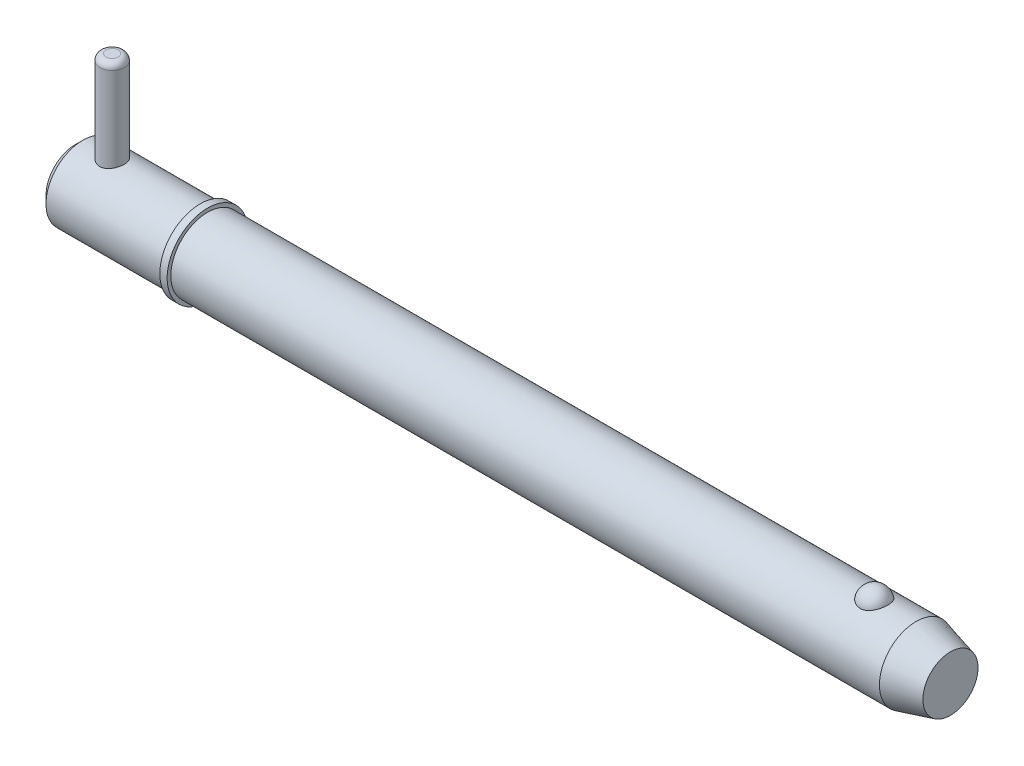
ISO-10303-21;
HEADER;
FILE_DESCRIPTION(('STEP AP214'),'2;1');
FILE_NAME('part.step','',(''),(''),'','','');
FILE_SCHEMA(('AUTOMOTIVE_DESIGN { 1 0 10303 214 1 1 1 1 }'));
ENDSEC;
DATA;
#1=APPLICATION_CONTEXT('core data for automotive mechanical design processes');
#2=APPLICATION_PROTOCOL_DEFINITION('international standard','automotive_design',2000,#1);
#3=PRODUCT_CONTEXT('',#1,'mechanical');
#4=PRODUCT('Part','Part','',(#3));
#5=PRODUCT_RELATED_PRODUCT_CATEGORY('part','',(#4));
#6=PRODUCT_DEFINITION_FORMATION('','',#4);
#7=PRODUCT_DEFINITION_CONTEXT('part definition',#1,'design');
#8=PRODUCT_DEFINITION('design','',#6,#7);
#9=PRODUCT_DEFINITION_SHAPE('','',#8);
#10=(LENGTH_UNIT() NAMED_UNIT(*) SI_UNIT(.MILLI.,.METRE.));
#11=(NAMED_UNIT(*) PLANE_ANGLE_UNIT() SI_UNIT($,.RADIAN.));
#12=(NAMED_UNIT(*) SI_UNIT($,.STERADIAN.) SOLID_ANGLE_UNIT());
#13=UNCERTAINTY_MEASURE_WITH_UNIT(LENGTH_MEASURE(1.E-05),#10,'distance_accuracy_value','');
#14=(GEOMETRIC_REPRESENTATION_CONTEXT(3) GLOBAL_UNCERTAINTY_ASSIGNED_CONTEXT((#13)) GLOBAL_UNIT_ASSIGNED_CONTEXT((#10,
#11,#12)) REPRESENTATION_CONTEXT('',''));
#15=CARTESIAN_POINT('',(0.,0.,0.));
#16=DIRECTION('',(0.,0.,1.));
#17=DIRECTION('',(1.,0.,0.));
#18=AXIS2_PLACEMENT_3D('',#15,#16,#17);
#19=CARTESIAN_POINT('',(7.14,24.605,0.));
#20=DIRECTION('',(0.,-1.,0.));
#21=DIRECTION('',(0.,0.,-1.));
#22=AXIS2_PLACEMENT_3D('',#19,#20,#21);
#23=CYLINDRICAL_SURFACE('',#22,2.38);
#24=CARTESIAN_POINT('',(7.14,-5.955,0.));
#25=DIRECTION('',(0.,1.,0.));
#26=DIRECTION('',(0.,0.,1.));
#27=AXIS2_PLACEMENT_3D('',#24,#25,#26);
#28=CIRCLE('',#27,2.38);
#29=CARTESIAN_POINT('',(7.14,-5.955,2.38));
#30=VERTEX_POINT('',#29);
#31=EDGE_CURVE('P0_E25',#30,#30,#28,.T.);
#32=ORIENTED_EDGE('',*,*,#31,.T.);
#33=EDGE_LOOP('',(#32));
#34=FACE_BOUND('',#33,.T.);
#35=CARTESIAN_POINT('',(7.14,23.415,0.));
#36=DIRECTION('',(0.,1.,0.));
#37=DIRECTION('',(0.,0.,1.));
#38=AXIS2_PLACEMENT_3D('',#35,#36,#37);
#39=CIRCLE('',#38,2.38);
#40=CARTESIAN_POINT('',(7.14,23.415,2.38));
#41=VERTEX_POINT('',#40);
#42=EDGE_CURVE('P0_E29',#41,#41,#39,.F.);
#43=ORIENTED_EDGE('',*,*,#42,.T.);
#44=EDGE_LOOP('',(#43));
#45=FACE_BOUND('',#44,.T.);
#46=ADVANCED_FACE('P0_F14',(#34,#45),#23,.T.);
#47=CARTESIAN_POINT('',(7.14,24.605,0.));
#48=DIRECTION('',(0.,1.,0.));
#49=DIRECTION('',(0.,0.,1.));
#50=AXIS2_PLACEMENT_3D('',#47,#48,#49);
#51=PLANE('',#50);
#52=CARTESIAN_POINT('',(7.14,24.605,0.));
#53=DIRECTION('',(0.,1.,0.));
#54=DIRECTION('',(0.,0.,1.));
#55=AXIS2_PLACEMENT_3D('',#52,#53,#54);
#56=CIRCLE('',#55,1.19);
#57=CARTESIAN_POINT('',(7.14,24.605,1.19));
#58=VERTEX_POINT('',#57);
#59=EDGE_CURVE('P0_E10',#58,#58,#56,.T.);
#60=ORIENTED_EDGE('',*,*,#59,.T.);
#61=EDGE_LOOP('',(#60));
#62=FACE_BOUND('',#61,.T.);
#63=ADVANCED_FACE('P0_F46',(#62),#51,.T.);
#64=CARTESIAN_POINT('',(7.14,-7.145,0.));
#65=DIRECTION('',(0.,1.,0.));
#66=DIRECTION('',(0.,0.,1.));
#67=AXIS2_PLACEMENT_3D('',#64,#65,#66);
#68=PLANE('',#67);
#69=CARTESIAN_POINT('',(7.14,-7.145,0.));
#70=DIRECTION('',(0.,1.,0.));
#71=DIRECTION('',(0.,0.,1.));
#72=AXIS2_PLACEMENT_3D('',#69,#70,#71);
#73=CIRCLE('',#72,1.19);
#74=CARTESIAN_POINT('',(7.14,-7.145,1.19));
#75=VERTEX_POINT('',#74);
#76=EDGE_CURVE('P0_E21',#75,#75,#73,.F.);
#77=ORIENTED_EDGE('',*,*,#76,.T.);
#78=EDGE_LOOP('',(#77));
#79=FACE_BOUND('',#78,.T.);
#80=ADVANCED_FACE('P0_F43',(#79),#68,.F.);
#81=CARTESIAN_POINT('',(7.14,-5.955,0.));
#82=DIRECTION('',(0.,1.,0.));
#83=DIRECTION('',(0.,0.,1.));
#84=AXIS2_PLACEMENT_3D('',#81,#82,#83);
#85=DEGENERATE_TOROIDAL_SURFACE('',#84,1.19,1.19,.T.);
#86=ORIENTED_EDGE('',*,*,#76,.F.);
#87=EDGE_LOOP('',(#86));
#88=FACE_BOUND('',#87,.T.);
#89=ORIENTED_EDGE('',*,*,#31,.F.);
#90=EDGE_LOOP('',(#89));
#91=FACE_BOUND('',#90,.T.);
#92=ADVANCED_FACE('P0_F38',(#88,#91),#85,.T.);
#93=CARTESIAN_POINT('',(7.14,23.415,0.));
#94=DIRECTION('',(0.,1.,0.));
#95=DIRECTION('',(0.,0.,1.));
#96=AXIS2_PLACEMENT_3D('',#93,#94,#95);
#97=DEGENERATE_TOROIDAL_SURFACE('',#96,1.19,1.19,.T.);
#98=ORIENTED_EDGE('',*,*,#42,.F.);
#99=EDGE_LOOP('',(#98));
#100=FACE_BOUND('',#99,.T.);
#101=ORIENTED_EDGE('',*,*,#59,.F.);
#102=EDGE_LOOP('',(#101));
#103=FACE_BOUND('',#102,.T.);
#104=ADVANCED_FACE('P0_F16',(#100,#103),#97,.T.);
#105=CLOSED_SHELL('',(#46,#63,#80,#92,#104));
#106=MANIFOLD_SOLID_BREP('P0_B1',#105);
#107=CARTESIAN_POINT('',(0.,0.,0.));
#108=DIRECTION('',(1.,0.,0.));
#109=DIRECTION('',(0.,0.,-1.));
#110=AXIS2_PLACEMENT_3D('',#107,#108,#109);
#111=CYLINDRICAL_SURFACE('',#110,7.145);
#112=CARTESIAN_POINT('',(163.48362424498,0.,0.));
#113=DIRECTION('',(1.,0.,0.));
#114=DIRECTION('',(0.,0.,-1.));
#115=AXIS2_PLACEMENT_3D('',#112,#113,#114);
#116=CIRCLE('',#115,7.145);
#117=CARTESIAN_POINT('',(163.48362424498,0.,-7.145));
#118=VERTEX_POINT('',#117);
#119=EDGE_CURVE('P1_E81',#118,#118,#116,.T.);
#120=ORIENTED_EDGE('',*,*,#119,.F.);
#121=EDGE_LOOP('',(#120));
#122=FACE_BOUND('',#121,.T.);
#123=CARTESIAN_POINT('',(25.7,0.,0.));
#124=DIRECTION('',(1.,0.,0.));
#125=DIRECTION('',(0.,0.,-1.));
#126=AXIS2_PLACEMENT_3D('',#123,#124,#125);
#127=CIRCLE('',#126,7.145);
#128=CARTESIAN_POINT('',(25.7,0.,-7.145));
#129=VERTEX_POINT('',#128);
#130=EDGE_CURVE('P1_E85',#129,#129,#127,.T.);
#131=ORIENTED_EDGE('',*,*,#130,.T.);
#132=EDGE_LOOP('',(#131));
#133=FACE_BOUND('',#132,.T.);
#134=CARTESIAN_POINT('',(155.339503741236,6.60328629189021,2.72903557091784));
#135=CARTESIAN_POINT('',(155.198315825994,6.60329644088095,2.7290249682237));
#136=CARTESIAN_POINT('',(155.056883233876,6.60799490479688,2.71772840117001));
#137=CARTESIAN_POINT('',(154.777955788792,6.62628236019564,2.6728193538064));
#138=CARTESIAN_POINT('',(154.640472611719,6.63989534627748,2.63914664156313));
#139=CARTESIAN_POINT('',(154.373889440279,6.67440775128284,2.55059642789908));
#140=CARTESIAN_POINT('',(154.244768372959,6.69528793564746,2.49577486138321));
#141=CARTESIAN_POINT('',(153.997869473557,6.74205585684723,2.36651799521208));
#142=CARTESIAN_POINT('',(153.880086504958,6.76794130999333,2.2920916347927));
#143=CARTESIAN_POINT('',(153.65516710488,6.82286177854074,2.12312937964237));
#144=CARTESIAN_POINT('',(153.548440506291,6.85196655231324,2.0280710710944));
#145=CARTESIAN_POINT('',(153.351918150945,6.90970232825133,1.82167822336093));
#146=CARTESIAN_POINT('',(153.262127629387,6.93833318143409,1.71033867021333));
#147=CARTESIAN_POINT('',(153.097667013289,6.9935167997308,1.46891951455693));
#148=CARTESIAN_POINT('',(153.023844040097,7.01992110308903,1.33822781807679));
#149=CARTESIAN_POINT('',(152.898088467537,7.06643385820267,1.0656656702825));
#150=CARTESIAN_POINT('',(152.84615735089,7.08654188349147,0.923794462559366));
#151=CARTESIAN_POINT('',(152.764732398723,7.11862399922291,0.630993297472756));
#152=CARTESIAN_POINT('',(152.735516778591,7.13049704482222,0.479974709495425));
#153=CARTESIAN_POINT('',(152.701174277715,7.14449484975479,0.174782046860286));
#154=CARTESIAN_POINT('',(152.696046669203,7.14661990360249,0.020608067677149));
#155=CARTESIAN_POINT('',(152.709938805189,7.14092465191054,-0.285506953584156));
#156=CARTESIAN_POINT('',(152.728810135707,7.1331654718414,-0.437455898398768));
#157=CARTESIAN_POINT('',(152.790062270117,7.10859076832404,-0.73577860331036));
#158=CARTESIAN_POINT('',(152.832443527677,7.0917750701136,-0.882152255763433));
#159=CARTESIAN_POINT('',(152.939934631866,7.05076716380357,-1.16543149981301));
#160=CARTESIAN_POINT('',(153.005075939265,7.02656475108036,-1.30232366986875));
#161=CARTESIAN_POINT('',(153.156759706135,6.97329145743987,-1.56265907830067));
#162=CARTESIAN_POINT('',(153.243303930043,6.94422017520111,-1.68610120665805));
#163=CARTESIAN_POINT('',(153.436465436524,6.88415108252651,-1.91671004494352));
#164=CARTESIAN_POINT('',(153.543180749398,6.85314438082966,-2.02379244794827));
#165=CARTESIAN_POINT('',(153.773974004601,6.79282069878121,-2.21787433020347));
#166=CARTESIAN_POINT('',(153.898050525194,6.76350358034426,-2.30487545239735));
#167=CARTESIAN_POINT('',(154.157678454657,6.71060580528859,-2.45458647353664));
#168=CARTESIAN_POINT('',(154.292938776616,6.68691885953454,-2.51776240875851));
#169=CARTESIAN_POINT('',(154.573277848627,6.64741247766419,-2.62030218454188));
#170=CARTESIAN_POINT('',(154.718352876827,6.63159007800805,-2.65967499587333));
#171=CARTESIAN_POINT('',(155.006347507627,6.61038594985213,-2.71193301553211));
#172=CARTESIAN_POINT('',(155.14900807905,6.60451880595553,-2.72605165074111));
#173=CARTESIAN_POINT('',(155.434800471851,6.60240611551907,-2.73116688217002));
#174=CARTESIAN_POINT('',(155.577932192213,6.60615862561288,-2.7221681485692));
#175=CARTESIAN_POINT('',(155.855848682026,6.62256094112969,-2.68200435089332));
#176=CARTESIAN_POINT('',(155.990754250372,6.63492533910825,-2.65154998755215));
#177=CARTESIAN_POINT('',(156.25332009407,6.66687445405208,-2.57015684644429));
#178=CARTESIAN_POINT('',(156.38097978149,6.68645975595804,-2.51921640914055));
#179=CARTESIAN_POINT('',(156.628577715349,6.73127274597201,-2.39693610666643));
#180=CARTESIAN_POINT('',(156.748287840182,6.7566138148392,-2.32517694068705));
#181=CARTESIAN_POINT('',(156.974159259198,6.81006003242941,-2.16363812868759));
#182=CARTESIAN_POINT('',(157.080317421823,6.83816581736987,-2.07385432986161));
#183=CARTESIAN_POINT('',(157.281862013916,6.89580469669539,-1.87357235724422));
#184=CARTESIAN_POINT('',(157.376440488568,6.92533863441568,-1.76226074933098));
#185=CARTESIAN_POINT('',(157.546332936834,6.98139526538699,-1.5251169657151));
#186=CARTESIAN_POINT('',(157.621643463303,7.0079174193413,-1.39928219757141));
#187=CARTESIAN_POINT('',(157.753595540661,7.05607625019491,-1.1321597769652));
#188=CARTESIAN_POINT('',(157.809568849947,7.07753119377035,-0.990508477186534));
#189=CARTESIAN_POINT('',(157.898296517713,7.11222355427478,-0.699154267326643));
#190=CARTESIAN_POINT('',(157.931050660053,7.12546089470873,-0.549451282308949));
#191=CARTESIAN_POINT('',(157.972689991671,7.14237584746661,-0.246120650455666));
#192=CARTESIAN_POINT('',(157.981558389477,7.14604673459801,-0.0924903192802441));
#193=CARTESIAN_POINT('',(157.975194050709,7.14343510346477,0.214181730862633));
#194=CARTESIAN_POINT('',(157.959961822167,7.13715279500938,0.367223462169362));
#195=CARTESIAN_POINT('',(157.905845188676,7.1153294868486,0.667595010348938));
#196=CARTESIAN_POINT('',(157.867077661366,7.09983424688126,0.814949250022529));
#197=CARTESIAN_POINT('',(157.766770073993,7.06119140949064,1.1006322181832));
#198=CARTESIAN_POINT('',(157.705228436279,7.03804328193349,1.23896032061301));
#199=CARTESIAN_POINT('',(157.560207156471,6.98632429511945,1.50352300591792));
#200=CARTESIAN_POINT('',(157.476606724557,6.95772382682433,1.62968561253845));
#201=CARTESIAN_POINT('',(157.28938046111,6.89823072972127,1.86554304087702));
#202=CARTESIAN_POINT('',(157.185755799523,6.86733823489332,1.97523882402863));
#203=CARTESIAN_POINT('',(156.961076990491,6.80676456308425,2.174822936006));
#204=CARTESIAN_POINT('',(156.840067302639,6.7770805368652,2.26476035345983));
#205=CARTESIAN_POINT('',(156.583340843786,6.7223050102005,2.42252989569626));
#206=CARTESIAN_POINT('',(156.44761851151,6.69721525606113,2.4903536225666));
#207=CARTESIAN_POINT('',(156.170402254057,6.65552591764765,2.59967646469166));
#208=CARTESIAN_POINT('',(156.029281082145,6.63865794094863,2.6420201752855));
#209=CARTESIAN_POINT('',(155.741444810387,6.61425039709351,2.70255841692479));
#210=CARTESIAN_POINT('',(155.594748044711,6.606682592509,2.72082606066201));
#211=CARTESIAN_POINT('',(155.411679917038,6.60358754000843,2.72830331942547));
#212=CARTESIAN_POINT('',(155.375599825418,6.60328369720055,2.72903828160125));
#213=CARTESIAN_POINT('',(155.339503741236,6.60328629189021,2.72903557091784));
#214=B_SPLINE_CURVE_WITH_KNOTS('',3,(#134,#135,#136,#137,#138,#139,#140,#141,#142,#143,#144,
#145,#146,#147,#148,#149,#150,#151,#152,#153,#154,#155,#156,#157,#158,#159,#160,#161,#162,#163,
#164,#165,#166,#167,#168,#169,#170,#171,#172,#173,#174,#175,#176,#177,#178,#179,#180,#181,#182,
#183,#184,#185,#186,#187,#188,#189,#190,#191,#192,#193,#194,#195,#196,#197,#198,#199,#200,#201,
#202,#203,#204,#205,#206,#207,#208,#209,#210,#211,#212,#213),.UNSPECIFIED.,.T.,.F.,(4,2,2,2,2,2,
2,2,2,2,2,2,2,2,2,2,2,2,2,2,2,2,2,2,2,2,2,2,2,2,2,2,2,2,2,2,2,2,2,4),(0.,0.423468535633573,
0.848081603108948,1.27157926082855,1.69488414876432,2.13051395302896,2.56627819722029,
3.02136706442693,3.47648674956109,3.93709649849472,4.39769233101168,4.85545355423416,
5.31322361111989,5.77162895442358,6.23007210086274,6.6908033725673,7.15149693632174,
7.60264329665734,8.05361952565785,8.48189729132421,8.91008854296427,9.32472524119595,
9.73939553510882,10.1630783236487,10.5868588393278,11.0319070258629,11.4770347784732,
11.9362874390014,12.3955443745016,12.8551240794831,13.3146940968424,13.7720003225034,
14.2293382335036,14.6892343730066,15.1491036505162,15.6078171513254,16.0667046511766,
16.5093965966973,16.9507410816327,17.0590049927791),.UNSPECIFIED.);
#215=CARTESIAN_POINT('',(155.339503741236,6.60328629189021,2.72903557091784));
#216=VERTEX_POINT('',#215);
#217=EDGE_CURVE('P1_E35',#216,#216,#214,.T.);
#218=ORIENTED_EDGE('',*,*,#217,.T.);
#219=EDGE_LOOP('',(#218));
#220=FACE_BOUND('',#219,.T.);
#221=ADVANCED_FACE('P1_F13',(#122,#133,#220),#111,.T.);
#222=CARTESIAN_POINT('',(0.,0.,0.));
#223=DIRECTION('',(-1.,0.,0.));
#224=DIRECTION('',(0.,0.,1.));
#225=AXIS2_PLACEMENT_3D('',#222,#223,#224);
#226=PLANE('',#225);
#227=CARTESIAN_POINT('',(0.,0.,0.));
#228=DIRECTION('',(1.,0.,0.));
#229=DIRECTION('',(0.,0.,-1.));
#230=AXIS2_PLACEMENT_3D('',#227,#228,#229);
#231=CIRCLE('',#230,5.716);
#232=CARTESIAN_POINT('',(0.,0.,-5.716));
#233=VERTEX_POINT('',#232);
#234=EDGE_CURVE('P1_E9',#233,#233,#231,.T.);
#235=ORIENTED_EDGE('',*,*,#234,.F.);
#236=EDGE_LOOP('',(#235));
#237=FACE_BOUND('',#236,.T.);
#238=ADVANCED_FACE('P1_F15',(#237),#226,.T.);
#239=CARTESIAN_POINT('',(1.42899999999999,0.,0.));
#240=DIRECTION('',(1.,0.,0.));
#241=DIRECTION('',(0.,0.,-1.));
#242=AXIS2_PLACEMENT_3D('',#239,#240,#241);
#243=CONICAL_SURFACE('',#242,7.145,0.78539816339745);
#244=ORIENTED_EDGE('',*,*,#234,.T.);
#245=EDGE_LOOP('',(#244));
#246=FACE_BOUND('',#245,.T.);
#247=CARTESIAN_POINT('',(1.42899999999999,0.,0.));
#248=DIRECTION('',(1.,0.,0.));
#249=DIRECTION('',(0.,0.,-1.));
#250=AXIS2_PLACEMENT_3D('',#247,#248,#249);
#251=CIRCLE('',#250,7.145);
#252=CARTESIAN_POINT('',(1.42899999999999,0.,-7.145));
#253=VERTEX_POINT('',#252);
#254=EDGE_CURVE('P1_E26',#253,#253,#251,.T.);
#255=ORIENTED_EDGE('',*,*,#254,.F.);
#256=EDGE_LOOP('',(#255));
#257=FACE_BOUND('',#256,.T.);
#258=ADVANCED_FACE('P1_F77',(#246,#257),#243,.T.);
#259=CARTESIAN_POINT('',(0.,0.,0.));
#260=DIRECTION('',(1.,0.,0.));
#261=DIRECTION('',(0.,0.,-1.));
#262=AXIS2_PLACEMENT_3D('',#259,#260,#261);
#263=CYLINDRICAL_SURFACE('',#262,7.145);
#264=CARTESIAN_POINT('',(7.14,-6.73695962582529,2.38));
#265=CARTESIAN_POINT('',(7.01035997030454,-6.73695921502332,2.38000059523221));
#266=CARTESIAN_POINT('',(6.88072348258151,-6.74074253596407,2.36937183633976));
#267=CARTESIAN_POINT('',(6.62529075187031,-6.75538853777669,2.32728080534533));
#268=CARTESIAN_POINT('',(6.49949514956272,-6.76625239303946,2.29581507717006));
#269=CARTESIAN_POINT('',(6.2554858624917,-6.79369535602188,2.21327763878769));
#270=CARTESIAN_POINT('',(6.13725786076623,-6.81026326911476,2.16224430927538));
#271=CARTESIAN_POINT('',(5.91100349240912,-6.84723128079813,2.04215132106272));
#272=CARTESIAN_POINT('',(5.80297937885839,-6.86763222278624,1.97308769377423));
#273=CARTESIAN_POINT('',(5.59597854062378,-6.91086152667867,1.81600414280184));
#274=CARTESIAN_POINT('',(5.49745861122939,-6.93375032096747,1.72739874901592));
#275=CARTESIAN_POINT('',(5.31636508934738,-6.97886546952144,1.53499636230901));
#276=CARTESIAN_POINT('',(5.23379405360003,-7.00109171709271,1.43119693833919));
#277=CARTESIAN_POINT('',(5.08487013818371,-7.04307708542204,1.20801318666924));
#278=CARTESIAN_POINT('',(5.01899578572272,-7.06275685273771,1.08829330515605));
#279=CARTESIAN_POINT('',(4.90850130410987,-7.09671988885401,0.838703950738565));
#280=CARTESIAN_POINT('',(4.86387545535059,-7.11100460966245,0.70883722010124));
#281=CARTESIAN_POINT('',(4.79869354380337,-7.13213998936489,0.44742990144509));
#282=CARTESIAN_POINT('',(4.77735497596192,-7.13923172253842,0.316104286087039));
#283=CARTESIAN_POINT('',(4.75686536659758,-7.14603777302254,0.0515578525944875));
#284=CARTESIAN_POINT('',(4.75770861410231,-7.14575398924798,-0.0816624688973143));
#285=CARTESIAN_POINT('',(4.78106216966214,-7.13800438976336,-0.340678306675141));
#286=CARTESIAN_POINT('',(4.80272255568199,-7.13082030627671,-0.466560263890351));
#287=CARTESIAN_POINT('',(4.86569013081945,-7.11043095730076,-0.712788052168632));
#288=CARTESIAN_POINT('',(4.90699865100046,-7.09722528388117,-0.833133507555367));
#289=CARTESIAN_POINT('',(5.00858673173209,-7.06591754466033,-1.06673173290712));
#290=CARTESIAN_POINT('',(5.06910834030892,-7.0477534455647,-1.17987058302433));
#291=CARTESIAN_POINT('',(5.20720514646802,-7.00841977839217,-1.39463797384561));
#292=CARTESIAN_POINT('',(5.28478508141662,-6.987249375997,-1.49626330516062));
#293=CARTESIAN_POINT('',(5.4590800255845,-6.94296010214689,-1.69017445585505));
#294=CARTESIAN_POINT('',(5.55652324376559,-6.91979641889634,-1.78179645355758));
#295=CARTESIAN_POINT('',(5.76558873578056,-6.87497076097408,-1.94761348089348));
#296=CARTESIAN_POINT('',(5.87721318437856,-6.85330901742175,-2.02180583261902));
#297=CARTESIAN_POINT('',(6.11357367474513,-6.81369485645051,-2.15157488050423));
#298=CARTESIAN_POINT('',(6.23847358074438,-6.79579956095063,-2.20687188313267));
#299=CARTESIAN_POINT('',(6.49655785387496,-6.76640630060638,-2.29542443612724));
#300=CARTESIAN_POINT('',(6.62973872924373,-6.75490565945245,-2.32868920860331));
#301=CARTESIAN_POINT('',(6.89417536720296,-6.74020933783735,-2.37088225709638));
#302=CARTESIAN_POINT('',(7.02524746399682,-6.73666278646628,-2.38083959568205));
#303=CARTESIAN_POINT('',(7.28721035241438,-6.73729555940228,-2.37904974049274));
#304=CARTESIAN_POINT('',(7.41810117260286,-6.7414734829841,-2.36730648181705));
#305=CARTESIAN_POINT('',(7.67130717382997,-6.75673471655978,-2.32337336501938));
#306=CARTESIAN_POINT('',(7.79376251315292,-6.76757635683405,-2.29189834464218));
#307=CARTESIAN_POINT('',(8.03162917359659,-6.79467771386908,-2.21025275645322));
#308=CARTESIAN_POINT('',(8.14703924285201,-6.8109383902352,-2.16007887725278));
#309=CARTESIAN_POINT('',(8.37159169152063,-6.84768362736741,-2.04065289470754));
#310=CARTESIAN_POINT('',(8.48041962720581,-6.86828569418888,-1.97084668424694));
#311=CARTESIAN_POINT('',(8.68518919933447,-6.91116416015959,-1.8147657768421));
#312=CARTESIAN_POINT('',(8.78112702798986,-6.93344105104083,-1.72848623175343));
#313=CARTESIAN_POINT('',(8.96215574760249,-6.97845348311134,-1.53698616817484));
#314=CARTESIAN_POINT('',(9.04650427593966,-7.00115965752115,-1.43105491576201));
#315=CARTESIAN_POINT('',(9.19627592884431,-7.04341676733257,-1.20598377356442));
#316=CARTESIAN_POINT('',(9.26169972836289,-7.06296781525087,-1.08684435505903));
#317=CARTESIAN_POINT('',(9.37116617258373,-7.0966205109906,-0.83933303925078));
#318=CARTESIAN_POINT('',(9.41534821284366,-7.11075755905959,-0.711027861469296));
#319=CARTESIAN_POINT('',(9.48132660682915,-7.13214194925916,-0.448245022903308));
#320=CARTESIAN_POINT('',(9.50313102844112,-7.13939177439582,-0.313769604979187));
#321=CARTESIAN_POINT('',(9.5230098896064,-7.14599771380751,-0.049254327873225));
#322=CARTESIAN_POINT('',(9.52215013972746,-7.14570837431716,0.0806974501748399));
#323=CARTESIAN_POINT('',(9.49935359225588,-7.13814116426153,0.338518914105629));
#324=CARTESIAN_POINT('',(9.47741850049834,-7.13086385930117,0.466388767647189));
#325=CARTESIAN_POINT('',(9.4138005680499,-7.11026814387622,0.714400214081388));
#326=CARTESIAN_POINT('',(9.37243609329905,-7.09704726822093,0.834632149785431));
#327=CARTESIAN_POINT('',(9.27142829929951,-7.06592602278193,1.06649582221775));
#328=CARTESIAN_POINT('',(9.2117816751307,-7.04802480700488,1.1781259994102));
#329=CARTESIAN_POINT('',(9.07336776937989,-7.00856499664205,1.39411030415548));
#330=CARTESIAN_POINT('',(8.99397590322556,-6.98689577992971,1.49804368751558));
#331=CARTESIAN_POINT('',(8.81938810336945,-6.9426110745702,1.69146078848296));
#332=CARTESIAN_POINT('',(8.72418713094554,-6.91999528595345,1.78093988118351));
#333=CARTESIAN_POINT('',(8.51623540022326,-6.87531507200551,1.94646188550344));
#334=CARTESIAN_POINT('',(8.4029442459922,-6.85330672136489,2.02184316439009));
#335=CARTESIAN_POINT('',(8.16461714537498,-6.81342065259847,2.1524427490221));
#336=CARTESIAN_POINT('',(8.03958429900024,-6.7955418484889,2.20766635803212));
#337=CARTESIAN_POINT('',(7.78712566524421,-6.76686117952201,2.29403636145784));
#338=CARTESIAN_POINT('',(7.66006989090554,-6.75577342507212,2.32616709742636));
#339=CARTESIAN_POINT('',(7.40200728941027,-6.74082409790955,2.36914495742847));
#340=CARTESIAN_POINT('',(7.27100183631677,-6.73696004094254,2.37999939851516));
#341=CARTESIAN_POINT('',(7.14,-6.73695962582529,2.38));
#342=B_SPLINE_CURVE_WITH_KNOTS('',3,(#264,#265,#266,#267,#268,#269,#270,#271,#272,#273,#274,
#275,#276,#277,#278,#279,#280,#281,#282,#283,#284,#285,#286,#287,#288,#289,#290,#291,#292,#293,
#294,#295,#296,#297,#298,#299,#300,#301,#302,#303,#304,#305,#306,#307,#308,#309,#310,#311,#312,
#313,#314,#315,#316,#317,#318,#319,#320,#321,#322,#323,#324,#325,#326,#327,#328,#329,#330,#331,
#332,#333,#334,#335,#336,#337,#338,#339,#340,#341),.UNSPECIFIED.,.T.,.F.,(4,2,2,2,2,2,2,2,2,2,2,
2,2,2,2,2,2,2,2,2,2,2,2,2,2,2,2,2,2,2,2,2,2,2,2,2,2,2,4),(0.,0.388434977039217,
0.776934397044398,1.16467566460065,1.55250234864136,1.9540847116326,2.35573139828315,
2.76784120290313,3.17984001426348,3.57752248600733,3.97510257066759,4.35711073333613,
4.7391447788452,5.12619663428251,5.51335611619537,5.91871976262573,6.3241456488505,
6.73533623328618,7.14635459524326,7.53885245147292,7.93127914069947,8.31025106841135,
8.68929014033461,9.08033871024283,9.47150254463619,9.88145528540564,10.2913934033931,
10.6986033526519,11.1056664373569,11.4936225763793,11.8815473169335,12.2633262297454,
12.645174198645,13.0411187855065,13.437189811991,13.8487371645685,14.2601761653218,
14.6528265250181,15.0453418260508),.UNSPECIFIED.);
#343=CARTESIAN_POINT('',(7.14,-6.73695962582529,2.38));
#344=VERTEX_POINT('',#343);
#345=EDGE_CURVE('P1_E17',#344,#344,#342,.T.);
#346=ORIENTED_EDGE('',*,*,#345,.F.);
#347=EDGE_LOOP('',(#346));
#348=FACE_BOUND('',#347,.T.);
#349=CARTESIAN_POINT('',(7.14,6.73695962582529,2.38));
#350=CARTESIAN_POINT('',(7.26964002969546,6.73695921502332,2.38000059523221));
#351=CARTESIAN_POINT('',(7.39927651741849,6.74074253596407,2.36937183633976));
#352=CARTESIAN_POINT('',(7.65470924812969,6.75538853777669,2.32728080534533));
#353=CARTESIAN_POINT('',(7.78050485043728,6.76625239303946,2.29581507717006));
#354=CARTESIAN_POINT('',(8.02451413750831,6.79369535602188,2.21327763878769));
#355=CARTESIAN_POINT('',(8.14274213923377,6.81026326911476,2.16224430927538));
#356=CARTESIAN_POINT('',(8.36899650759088,6.84723128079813,2.04215132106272));
#357=CARTESIAN_POINT('',(8.47702062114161,6.86763222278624,1.97308769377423));
#358=CARTESIAN_POINT('',(8.68402145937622,6.91086152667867,1.81600414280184));
#359=CARTESIAN_POINT('',(8.78254138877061,6.93375032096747,1.72739874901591));
#360=CARTESIAN_POINT('',(8.96363491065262,6.97886546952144,1.53499636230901));
#361=CARTESIAN_POINT('',(9.04620594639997,7.00109171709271,1.43119693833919));
#362=CARTESIAN_POINT('',(9.19512986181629,7.04307708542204,1.20801318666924));
#363=CARTESIAN_POINT('',(9.26100421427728,7.06275685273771,1.08829330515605));
#364=CARTESIAN_POINT('',(9.37149869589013,7.09671988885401,0.838703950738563));
#365=CARTESIAN_POINT('',(9.41612454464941,7.11100460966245,0.708837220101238));
#366=CARTESIAN_POINT('',(9.48130645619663,7.13213998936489,0.447429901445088));
#367=CARTESIAN_POINT('',(9.50264502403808,7.13923172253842,0.316104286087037));
#368=CARTESIAN_POINT('',(9.52313463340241,7.14603777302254,0.0515578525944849));
#369=CARTESIAN_POINT('',(9.52229138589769,7.14575398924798,-0.0816624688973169));
#370=CARTESIAN_POINT('',(9.49893783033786,7.13800438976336,-0.340678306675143));
#371=CARTESIAN_POINT('',(9.47727744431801,7.13082030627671,-0.466560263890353));
#372=CARTESIAN_POINT('',(9.41430986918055,7.11043095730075,-0.712788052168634));
#373=CARTESIAN_POINT('',(9.37300134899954,7.09722528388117,-0.833133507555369));
#374=CARTESIAN_POINT('',(9.27141326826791,7.06591754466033,-1.06673173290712));
#375=CARTESIAN_POINT('',(9.21089165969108,7.0477534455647,-1.17987058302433));
#376=CARTESIAN_POINT('',(9.07279485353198,7.00841977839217,-1.39463797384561));
#377=CARTESIAN_POINT('',(8.99521491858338,6.987249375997,-1.49626330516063));
#378=CARTESIAN_POINT('',(8.82091997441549,6.94296010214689,-1.69017445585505));
#379=CARTESIAN_POINT('',(8.72347675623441,6.91979641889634,-1.78179645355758));
#380=CARTESIAN_POINT('',(8.51441126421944,6.87497076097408,-1.94761348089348));
#381=CARTESIAN_POINT('',(8.40278681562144,6.85330901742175,-2.02180583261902));
#382=CARTESIAN_POINT('',(8.16642632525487,6.81369485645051,-2.15157488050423));
#383=CARTESIAN_POINT('',(8.04152641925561,6.79579956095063,-2.20687188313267));
#384=CARTESIAN_POINT('',(7.78344214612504,6.76640630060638,-2.29542443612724));
#385=CARTESIAN_POINT('',(7.65026127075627,6.75490565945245,-2.32868920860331));
#386=CARTESIAN_POINT('',(7.38582463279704,6.74020933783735,-2.37088225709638));
#387=CARTESIAN_POINT('',(7.25475253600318,6.73666278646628,-2.38083959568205));
#388=CARTESIAN_POINT('',(6.99278964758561,6.73729555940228,-2.37904974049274));
#389=CARTESIAN_POINT('',(6.86189882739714,6.7414734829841,-2.36730648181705));
#390=CARTESIAN_POINT('',(6.60869282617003,6.75673471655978,-2.32337336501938));
#391=CARTESIAN_POINT('',(6.48623748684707,6.76757635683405,-2.29189834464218));
#392=CARTESIAN_POINT('',(6.2483708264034,6.79467771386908,-2.21025275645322));
#393=CARTESIAN_POINT('',(6.13296075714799,6.8109383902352,-2.16007887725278));
#394=CARTESIAN_POINT('',(5.90840830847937,6.84768362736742,-2.04065289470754));
#395=CARTESIAN_POINT('',(5.79958037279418,6.86828569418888,-1.97084668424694));
#396=CARTESIAN_POINT('',(5.59481080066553,6.91116416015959,-1.8147657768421));
#397=CARTESIAN_POINT('',(5.49887297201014,6.93344105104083,-1.72848623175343));
#398=CARTESIAN_POINT('',(5.31784425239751,6.97845348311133,-1.53698616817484));
#399=CARTESIAN_POINT('',(5.23349572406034,7.00115965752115,-1.43105491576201));
#400=CARTESIAN_POINT('',(5.08372407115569,7.04341676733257,-1.20598377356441));
#401=CARTESIAN_POINT('',(5.01830027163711,7.06296781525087,-1.08684435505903));
#402=CARTESIAN_POINT('',(4.90883382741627,7.0966205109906,-0.839333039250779));
#403=CARTESIAN_POINT('',(4.86465178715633,7.11075755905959,-0.711027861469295));
#404=CARTESIAN_POINT('',(4.79867339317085,7.13214194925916,-0.448245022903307));
#405=CARTESIAN_POINT('',(4.77686897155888,7.13939177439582,-0.313769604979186));
#406=CARTESIAN_POINT('',(4.7569901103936,7.14599771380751,-0.0492543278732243));
#407=CARTESIAN_POINT('',(4.75784986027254,7.14570837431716,0.0806974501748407));
#408=CARTESIAN_POINT('',(4.78064640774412,7.13814116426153,0.33851891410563));
#409=CARTESIAN_POINT('',(4.80258149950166,7.13086385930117,0.46638876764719));
#410=CARTESIAN_POINT('',(4.8661994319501,7.11026814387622,0.714400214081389));
#411=CARTESIAN_POINT('',(4.90756390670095,7.09704726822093,0.834632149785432));
#412=CARTESIAN_POINT('',(5.00857170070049,7.06592602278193,1.06649582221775));
#413=CARTESIAN_POINT('',(5.0682183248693,7.04802480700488,1.1781259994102));
#414=CARTESIAN_POINT('',(5.20663223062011,7.00856499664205,1.39411030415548));
#415=CARTESIAN_POINT('',(5.28602409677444,6.98689577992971,1.49804368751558));
#416=CARTESIAN_POINT('',(5.46061189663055,6.9426110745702,1.69146078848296));
#417=CARTESIAN_POINT('',(5.55581286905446,6.91999528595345,1.78093988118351));
#418=CARTESIAN_POINT('',(5.76376459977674,6.87531507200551,1.94646188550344));
#419=CARTESIAN_POINT('',(5.8770557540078,6.85330672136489,2.02184316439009));
#420=CARTESIAN_POINT('',(6.11538285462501,6.81342065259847,2.1524427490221));
#421=CARTESIAN_POINT('',(6.24041570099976,6.7955418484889,2.20766635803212));
#422=CARTESIAN_POINT('',(6.4928743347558,6.76686117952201,2.29403636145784));
#423=CARTESIAN_POINT('',(6.61993010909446,6.75577342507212,2.32616709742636));
#424=CARTESIAN_POINT('',(6.87799271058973,6.74082409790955,2.36914495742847));
#425=CARTESIAN_POINT('',(7.00899816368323,6.73696004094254,2.37999939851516));
#426=CARTESIAN_POINT('',(7.14,6.73695962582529,2.38));
#427=B_SPLINE_CURVE_WITH_KNOTS('',3,(#349,#350,#351,#352,#353,#354,#355,#356,#357,#358,#359,
#360,#361,#362,#363,#364,#365,#366,#367,#368,#369,#370,#371,#372,#373,#374,#375,#376,#377,#378,
#379,#380,#381,#382,#383,#384,#385,#386,#387,#388,#389,#390,#391,#392,#393,#394,#395,#396,#397,
#398,#399,#400,#401,#402,#403,#404,#405,#406,#407,#408,#409,#410,#411,#412,#413,#414,#415,#416,
#417,#418,#419,#420,#421,#422,#423,#424,#425,#426),.UNSPECIFIED.,.T.,.F.,(4,2,2,2,2,2,2,2,2,2,2,
2,2,2,2,2,2,2,2,2,2,2,2,2,2,2,2,2,2,2,2,2,2,2,2,2,2,2,4),(0.,0.388434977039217,
0.776934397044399,1.16467566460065,1.55250234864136,1.9540847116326,2.35573139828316,
2.76784120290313,3.17984001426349,3.57752248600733,3.97510257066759,4.35711073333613,
4.73914477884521,5.12619663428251,5.51335611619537,5.91871976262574,6.3241456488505,
6.73533623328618,7.14635459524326,7.53885245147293,7.93127914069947,8.31025106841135,
8.68929014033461,9.08033871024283,9.47150254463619,9.88145528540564,10.2913934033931,
10.6986033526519,11.1056664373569,11.4936225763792,11.8815473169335,12.2633262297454,
12.645174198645,13.0411187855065,13.437189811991,13.8487371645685,14.2601761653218,
14.6528265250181,15.0453418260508),.UNSPECIFIED.);
#428=CARTESIAN_POINT('',(7.14,6.73695962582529,2.38));
#429=VERTEX_POINT('',#428);
#430=EDGE_CURVE('P1_E43',#429,#429,#427,.T.);
#431=ORIENTED_EDGE('',*,*,#430,.F.);
#432=EDGE_LOOP('',(#431));
#433=FACE_BOUND('',#432,.T.);
#434=ORIENTED_EDGE('',*,*,#254,.T.);
#435=EDGE_LOOP('',(#434));
#436=FACE_BOUND('',#435,.T.);
#437=CARTESIAN_POINT('',(24.271,0.,0.));
#438=DIRECTION('',(1.,0.,0.));
#439=DIRECTION('',(0.,0.,-1.));
#440=AXIS2_PLACEMENT_3D('',#437,#438,#439);
#441=CIRCLE('',#440,7.145);
#442=CARTESIAN_POINT('',(24.271,0.,-7.145));
#443=VERTEX_POINT('',#442);
#444=EDGE_CURVE('P1_E31',#443,#443,#441,.T.);
#445=ORIENTED_EDGE('',*,*,#444,.F.);
#446=EDGE_LOOP('',(#445));
#447=FACE_BOUND('',#446,.T.);
#448=ADVANCED_FACE('P1_F103',(#348,#433,#436,#447),#263,.T.);
#449=CARTESIAN_POINT('',(24.271,7.145,0.));
#450=DIRECTION('',(-1.,0.,0.));
#451=DIRECTION('',(0.,0.,1.));
#452=AXIS2_PLACEMENT_3D('',#449,#450,#451);
#453=PLANE('',#452);
#454=ORIENTED_EDGE('',*,*,#444,.T.);
#455=EDGE_LOOP('',(#454));
#456=FACE_BOUND('',#455,.T.);
#457=CARTESIAN_POINT('',(24.271,0.,0.));
#458=DIRECTION('',(1.,0.,0.));
#459=DIRECTION('',(0.,0.,-1.));
#460=AXIS2_PLACEMENT_3D('',#457,#458,#459);
#461=CIRCLE('',#460,7.8595);
#462=CARTESIAN_POINT('',(24.271,0.,-7.8595));
#463=VERTEX_POINT('',#462);
#464=EDGE_CURVE('P1_E91',#463,#463,#461,.T.);
#465=ORIENTED_EDGE('',*,*,#464,.F.);
#466=EDGE_LOOP('',(#465));
#467=FACE_BOUND('',#466,.T.);
#468=ADVANCED_FACE('P1_F100',(#456,#467),#453,.T.);
#469=CARTESIAN_POINT('',(0.,0.,0.));
#470=DIRECTION('',(1.,0.,0.));
#471=DIRECTION('',(0.,0.,-1.));
#472=AXIS2_PLACEMENT_3D('',#469,#470,#471);
#473=CYLINDRICAL_SURFACE('',#472,7.8595);
#474=ORIENTED_EDGE('',*,*,#464,.T.);
#475=EDGE_LOOP('',(#474));
#476=FACE_BOUND('',#475,.T.);
#477=CARTESIAN_POINT('',(25.7,0.,0.));
#478=DIRECTION('',(1.,0.,0.));
#479=DIRECTION('',(0.,0.,-1.));
#480=AXIS2_PLACEMENT_3D('',#477,#478,#479);
#481=CIRCLE('',#480,7.8595);
#482=CARTESIAN_POINT('',(25.7,0.,-7.8595));
#483=VERTEX_POINT('',#482);
#484=EDGE_CURVE('P1_E88',#483,#483,#481,.T.);
#485=ORIENTED_EDGE('',*,*,#484,.F.);
#486=EDGE_LOOP('',(#485));
#487=FACE_BOUND('',#486,.T.);
#488=ADVANCED_FACE('P1_F68',(#476,#487),#473,.T.);
#489=CARTESIAN_POINT('',(25.7,7.8595,0.));
#490=DIRECTION('',(1.,0.,0.));
#491=DIRECTION('',(0.,0.,-1.));
#492=AXIS2_PLACEMENT_3D('',#489,#490,#491);
#493=PLANE('',#492);
#494=ORIENTED_EDGE('',*,*,#484,.T.);
#495=EDGE_LOOP('',(#494));
#496=FACE_BOUND('',#495,.T.);
#497=ORIENTED_EDGE('',*,*,#130,.F.);
#498=EDGE_LOOP('',(#497));
#499=FACE_BOUND('',#498,.T.);
#500=ADVANCED_FACE('P1_F62',(#496,#499),#493,.T.);
#501=CARTESIAN_POINT('',(170.15,0.,0.));
#502=DIRECTION('',(-1.,0.,0.));
#503=DIRECTION('',(0.,0.,1.));
#504=AXIS2_PLACEMENT_3D('',#501,#502,#503);
#505=CONICAL_SURFACE('',#504,5.35875000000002,0.261799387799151);
#506=ORIENTED_EDGE('',*,*,#119,.T.);
#507=EDGE_LOOP('',(#506));
#508=FACE_BOUND('',#507,.T.);
#509=CARTESIAN_POINT('',(170.15,0.,0.));
#510=DIRECTION('',(1.,0.,0.));
#511=DIRECTION('',(0.,0.,-1.));
#512=AXIS2_PLACEMENT_3D('',#509,#510,#511);
#513=CIRCLE('',#512,5.35875000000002);
#514=CARTESIAN_POINT('',(170.15,0.,-5.35875000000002));
#515=VERTEX_POINT('',#514);
#516=EDGE_CURVE('P1_E42',#515,#515,#513,.T.);
#517=ORIENTED_EDGE('',*,*,#516,.F.);
#518=EDGE_LOOP('',(#517));
#519=FACE_BOUND('',#518,.T.);
#520=ADVANCED_FACE('P1_F59',(#508,#519),#505,.T.);
#521=CARTESIAN_POINT('',(170.15,5.35875000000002,0.));
#522=DIRECTION('',(1.,0.,0.));
#523=DIRECTION('',(0.,0.,-1.));
#524=AXIS2_PLACEMENT_3D('',#521,#522,#523);
#525=PLANE('',#524);
#526=ORIENTED_EDGE('',*,*,#516,.T.);
#527=EDGE_LOOP('',(#526));
#528=FACE_BOUND('',#527,.T.);
#529=ADVANCED_FACE('P1_F55',(#528),#525,.T.);
#530=CARTESIAN_POINT('',(155.339503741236,6.4305,0.));
#531=DIRECTION('',(-1.,0.,0.));
#532=DIRECTION('',(0.,-1.,0.));
#533=AXIS2_PLACEMENT_3D('',#530,#531,#532);
#534=SPHERICAL_SURFACE('',#533,2.7345);
#535=ORIENTED_EDGE('',*,*,#217,.F.);
#536=EDGE_LOOP('',(#535));
#537=FACE_BOUND('',#536,.T.);
#538=ADVANCED_FACE('P1_F50',(#537),#534,.T.);
#539=CARTESIAN_POINT('',(7.14,-7.8595,0.));
#540=DIRECTION('',(0.,1.,0.));
#541=DIRECTION('',(0.,0.,1.));
#542=AXIS2_PLACEMENT_3D('',#539,#540,#541);
#543=CYLINDRICAL_SURFACE('',#542,2.38);
#544=ORIENTED_EDGE('',*,*,#345,.T.);
#545=EDGE_LOOP('',(#544));
#546=FACE_BOUND('',#545,.T.);
#547=ORIENTED_EDGE('',*,*,#430,.T.);
#548=EDGE_LOOP('',(#547));
#549=FACE_BOUND('',#548,.T.);
#550=ADVANCED_FACE('P1_F54',(#546,#549),#543,.F.);
#551=CLOSED_SHELL('',(#221,#238,#258,#448,#468,#488,#500,#520,#529,#538,#550));
#552=MANIFOLD_SOLID_BREP('P1_B1',#551);
#553=ADVANCED_BREP_SHAPE_REPRESENTATION('',(#18,#106,#552),#14);
#554=SHAPE_DEFINITION_REPRESENTATION(#9,#553);
ENDSEC;
END-ISO-10303-21;
